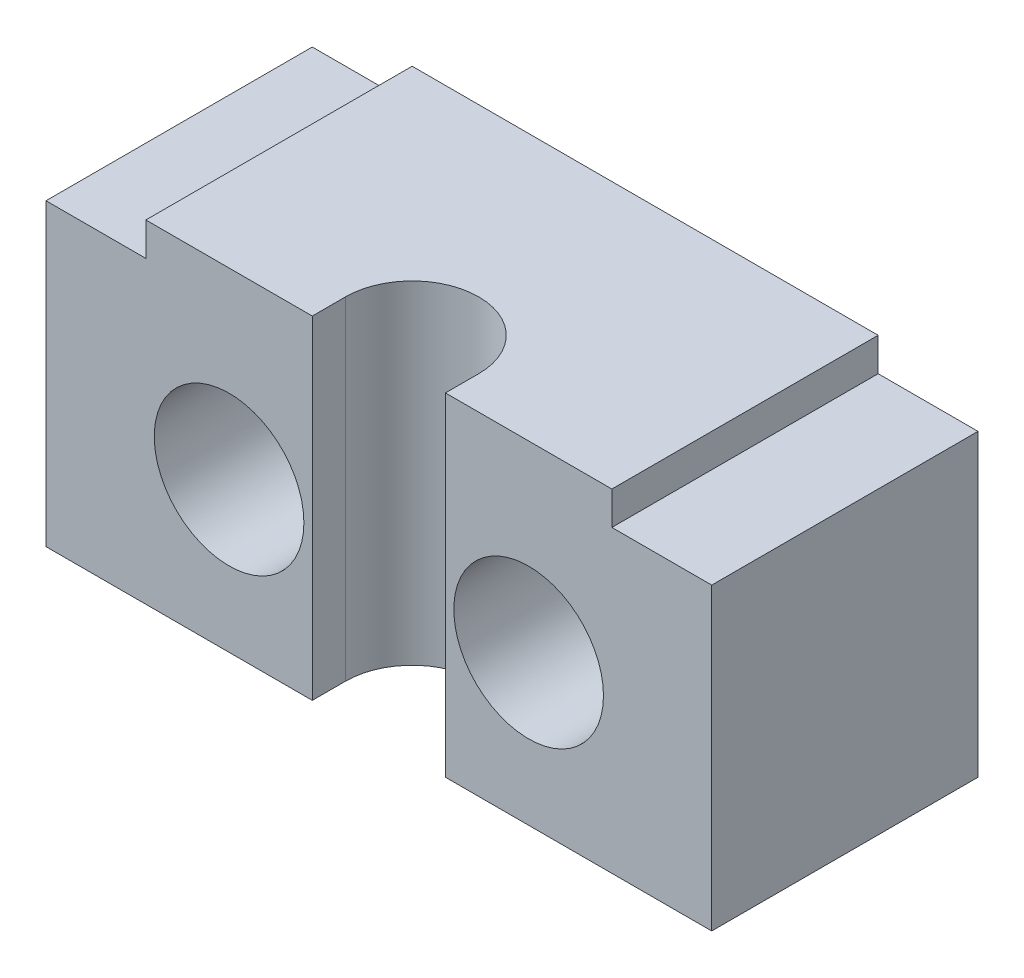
from build123d import *

# Parameters (mm, degrees)
SKETCH2_R           = 4.7625
BOSS_EXTRUDE1_DEPTH = 25.4
CUT_EXTRUDE1_START  = 11.1252
SKETCH3_R           = 7.1374
CUT_EXTRUDE1_DEPTH  = 25.4
CUT_EXTRUDE2_DEPTH  = 38.1


with BuildPart() as part:
    # Sketch2 → Boss-Extrude1 (new body)
    with BuildSketch(Plane.XY):
        Polygon((-31.75, 0), (0, 0), (31.75, 0), (31.75, 28.575), (22.225, 28.575), (22.225, 31.75), (-22.225, 31.75), (-22.225, 28.575), (-31.75, 28.575), align=None)
        with Locations((-14.2875, 14.2748)):
            Circle(SKETCH2_R, mode=Mode.SUBTRACT)
        with Locations((14.2875, 14.2748)):
            Circle(SKETCH2_R, mode=Mode.SUBTRACT)
    extrude(amount=BOSS_EXTRUDE1_DEPTH)

    # Sketch3 → Cut-Extrude1 (cut)
    with BuildSketch(Plane.XY.offset(CUT_EXTRUDE1_START)):
        with Locations((14.2875, 14.2748)):
            Circle(SKETCH3_R)
        with Locations((-14.2875, 14.2748)):
            Circle(SKETCH3_R)
    extrude(amount=CUT_EXTRUDE1_DEPTH, mode=Mode.SUBTRACT)

    # Sketch4 → Cut-Extrude2 (cut)
    with BuildSketch(Plane(origin=(0, 0, 0), x_dir=(1, 0, 0), z_dir=(0, 1, 0))):
        with BuildLine():
            Line((-6.35, -34.925), (-6.35, -22.225))
            ThreePointArc((-6.35, -22.225), (0, -15.875), (6.35, -22.225))
            Line((6.35, -22.225), (6.35, -34.925))
            ThreePointArc((6.35, -34.925), (0, -41.275), (-6.35, -34.925))
        make_face()
    extrude(amount=CUT_EXTRUDE2_DEPTH, mode=Mode.SUBTRACT)


solid = part.part
